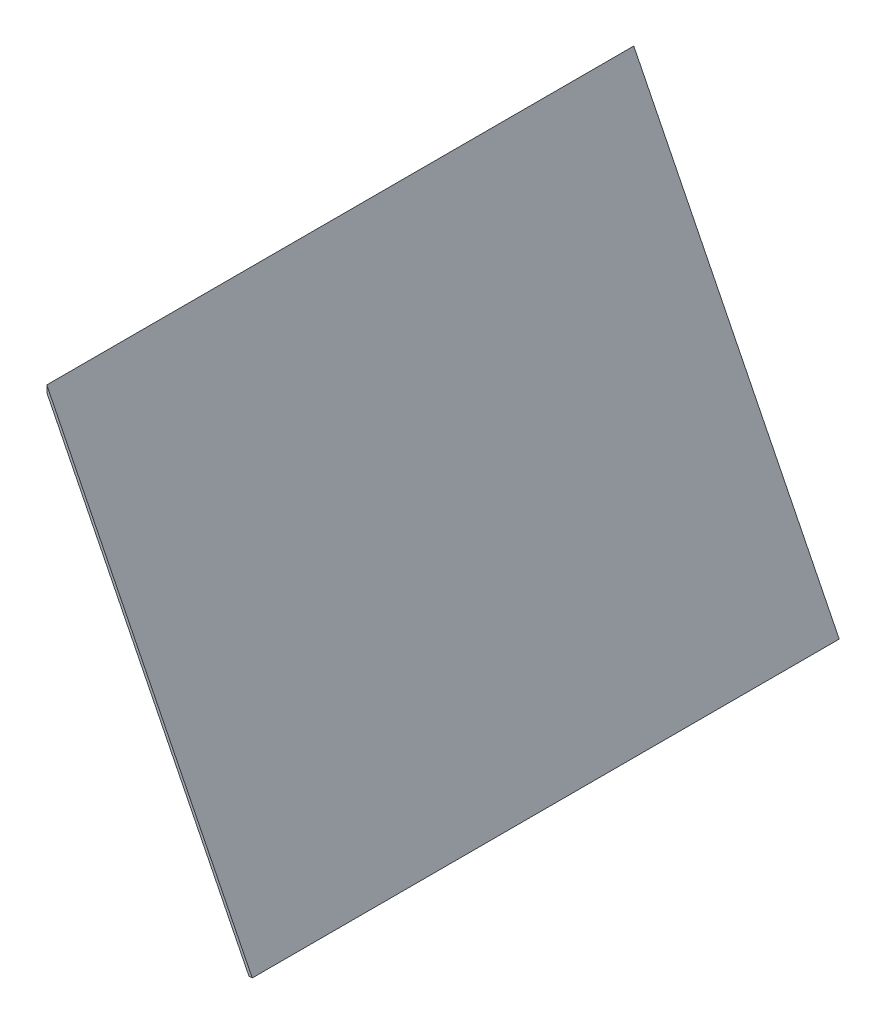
from build123d import *

# Parameters (mm, degrees)
EXTRUDE_1_DEPTH     = 20
CUT_EXTRUDE_1_DEPTH = 20


with BuildPart() as part:
    # Sketch 1 → Extrude 1 (new body)
    with BuildSketch(Plane.XY):
        Polygon((-7.42, 8.026666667), (-7.42, -5.973333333), (-0.42, -5.973333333), align=None)
    extrude(amount=EXTRUDE_1_DEPTH)

    # Sketch 3 → Cut-Extrude 1 (cut)
    with BuildSketch(Plane.XY):
        Polygon((-7.42, 7.801649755), (-0.532508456, -5.973333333), (-7.42, -5.973333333), align=None)
    extrude(amount=CUT_EXTRUDE_1_DEPTH, mode=Mode.SUBTRACT)


solid = part.part
